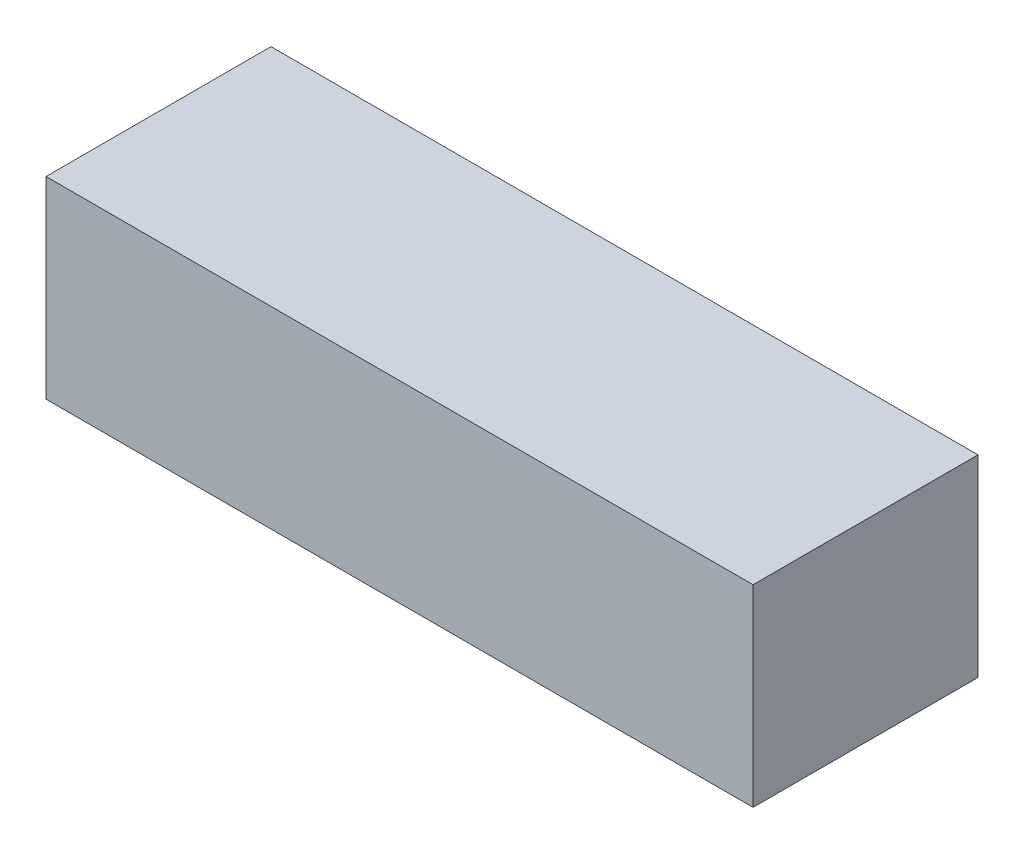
ISO-10303-21;
HEADER;
FILE_DESCRIPTION(('STEP AP214'),'2;1');
FILE_NAME('part.step','',(''),(''),'','','');
FILE_SCHEMA(('AUTOMOTIVE_DESIGN { 1 0 10303 214 1 1 1 1 }'));
ENDSEC;
DATA;
#1=APPLICATION_CONTEXT('core data for automotive mechanical design processes');
#2=APPLICATION_PROTOCOL_DEFINITION('international standard','automotive_design',2000,#1);
#3=PRODUCT_CONTEXT('',#1,'mechanical');
#4=PRODUCT('Part','Part','',(#3));
#5=PRODUCT_RELATED_PRODUCT_CATEGORY('part','',(#4));
#6=PRODUCT_DEFINITION_FORMATION('','',#4);
#7=PRODUCT_DEFINITION_CONTEXT('part definition',#1,'design');
#8=PRODUCT_DEFINITION('design','',#6,#7);
#9=PRODUCT_DEFINITION_SHAPE('','',#8);
#10=(LENGTH_UNIT() NAMED_UNIT(*) SI_UNIT(.MILLI.,.METRE.));
#11=(NAMED_UNIT(*) PLANE_ANGLE_UNIT() SI_UNIT($,.RADIAN.));
#12=(NAMED_UNIT(*) SI_UNIT($,.STERADIAN.) SOLID_ANGLE_UNIT());
#13=UNCERTAINTY_MEASURE_WITH_UNIT(LENGTH_MEASURE(1.E-05),#10,'distance_accuracy_value','');
#14=(GEOMETRIC_REPRESENTATION_CONTEXT(3) GLOBAL_UNCERTAINTY_ASSIGNED_CONTEXT((#13)) GLOBAL_UNIT_ASSIGNED_CONTEXT((#10,
#11,#12)) REPRESENTATION_CONTEXT('',''));
#15=CARTESIAN_POINT('',(0.,0.,0.));
#16=DIRECTION('',(0.,0.,1.));
#17=DIRECTION('',(1.,0.,0.));
#18=AXIS2_PLACEMENT_3D('',#15,#16,#17);
#19=CARTESIAN_POINT('',(-69.85,38.1,22.225));
#20=DIRECTION('',(1.,0.,0.));
#21=DIRECTION('',(0.,0.,-1.));
#22=AXIS2_PLACEMENT_3D('',#19,#20,#21);
#23=PLANE('',#22);
#24=DIRECTION('',(0.,0.,1.));
#25=VECTOR('',#24,1.);
#26=CARTESIAN_POINT('',(-69.85,0.,22.225));
#27=LINE('',#26,#25);
#28=CARTESIAN_POINT('',(-69.85,0.,-22.225));
#29=VERTEX_POINT('',#28);
#30=CARTESIAN_POINT('',(-69.85,0.,22.225));
#31=VERTEX_POINT('',#30);
#32=EDGE_CURVE('E114',#29,#31,#27,.T.);
#33=ORIENTED_EDGE('',*,*,#32,.T.);
#34=DIRECTION('',(0.,-1.,0.));
#35=VECTOR('',#34,1.);
#36=CARTESIAN_POINT('',(-69.85,38.1,22.225));
#37=LINE('',#36,#35);
#38=CARTESIAN_POINT('',(-69.85,38.1,22.225));
#39=VERTEX_POINT('',#38);
#40=EDGE_CURVE('E11',#39,#31,#37,.T.);
#41=ORIENTED_EDGE('',*,*,#40,.F.);
#42=DIRECTION('',(0.,0.,1.));
#43=VECTOR('',#42,1.);
#44=CARTESIAN_POINT('',(-69.85,38.1,22.225));
#45=LINE('',#44,#43);
#46=CARTESIAN_POINT('',(-69.85,38.1,-22.225));
#47=VERTEX_POINT('',#46);
#48=EDGE_CURVE('E97',#47,#39,#45,.T.);
#49=ORIENTED_EDGE('',*,*,#48,.F.);
#50=DIRECTION('',(0.,-1.,0.));
#51=VECTOR('',#50,1.);
#52=CARTESIAN_POINT('',(-69.85,38.1,-22.225));
#53=LINE('',#52,#51);
#54=EDGE_CURVE('E110',#47,#29,#53,.T.);
#55=ORIENTED_EDGE('',*,*,#54,.T.);
#56=EDGE_LOOP('',(#33,#41,#49,#55));
#57=FACE_BOUND('',#56,.T.);
#58=ADVANCED_FACE('F45',(#57),#23,.F.);
#59=CARTESIAN_POINT('',(69.85,38.1,22.225));
#60=DIRECTION('',(0.,0.,-1.));
#61=DIRECTION('',(-1.,0.,0.));
#62=AXIS2_PLACEMENT_3D('',#59,#60,#61);
#63=PLANE('',#62);
#64=DIRECTION('',(1.,0.,0.));
#65=VECTOR('',#64,1.);
#66=CARTESIAN_POINT('',(69.85,0.,22.225));
#67=LINE('',#66,#65);
#68=CARTESIAN_POINT('',(69.85,0.,22.225));
#69=VERTEX_POINT('',#68);
#70=EDGE_CURVE('E102',#31,#69,#67,.T.);
#71=ORIENTED_EDGE('',*,*,#70,.T.);
#72=DIRECTION('',(0.,-1.,0.));
#73=VECTOR('',#72,1.);
#74=CARTESIAN_POINT('',(69.85,38.1,22.225));
#75=LINE('',#74,#73);
#76=CARTESIAN_POINT('',(69.85,38.1,22.225));
#77=VERTEX_POINT('',#76);
#78=EDGE_CURVE('E54',#77,#69,#75,.T.);
#79=ORIENTED_EDGE('',*,*,#78,.F.);
#80=DIRECTION('',(1.,0.,0.));
#81=VECTOR('',#80,1.);
#82=CARTESIAN_POINT('',(69.85,38.1,22.225));
#83=LINE('',#82,#81);
#84=EDGE_CURVE('E92',#39,#77,#83,.T.);
#85=ORIENTED_EDGE('',*,*,#84,.F.);
#86=ORIENTED_EDGE('',*,*,#40,.T.);
#87=EDGE_LOOP('',(#71,#79,#85,#86));
#88=FACE_BOUND('',#87,.T.);
#89=ADVANCED_FACE('F101',(#88),#63,.F.);
#90=CARTESIAN_POINT('',(69.85,38.1,22.225));
#91=DIRECTION('',(-1.,0.,0.));
#92=DIRECTION('',(0.,0.,1.));
#93=AXIS2_PLACEMENT_3D('',#90,#91,#92);
#94=PLANE('',#93);
#95=DIRECTION('',(0.,0.,-1.));
#96=VECTOR('',#95,1.);
#97=CARTESIAN_POINT('',(69.85,0.,22.225));
#98=LINE('',#97,#96);
#99=CARTESIAN_POINT('',(69.85,0.,-22.225));
#100=VERTEX_POINT('',#99);
#101=EDGE_CURVE('E79',#69,#100,#98,.T.);
#102=ORIENTED_EDGE('',*,*,#101,.T.);
#103=DIRECTION('',(0.,-1.,0.));
#104=VECTOR('',#103,1.);
#105=CARTESIAN_POINT('',(69.85,38.1,-22.225));
#106=LINE('',#105,#104);
#107=CARTESIAN_POINT('',(69.85,38.1,-22.225));
#108=VERTEX_POINT('',#107);
#109=EDGE_CURVE('E104',#108,#100,#106,.T.);
#110=ORIENTED_EDGE('',*,*,#109,.F.);
#111=DIRECTION('',(0.,0.,-1.));
#112=VECTOR('',#111,1.);
#113=CARTESIAN_POINT('',(69.85,38.1,22.225));
#114=LINE('',#113,#112);
#115=EDGE_CURVE('E95',#77,#108,#114,.T.);
#116=ORIENTED_EDGE('',*,*,#115,.F.);
#117=ORIENTED_EDGE('',*,*,#78,.T.);
#118=EDGE_LOOP('',(#102,#110,#116,#117));
#119=FACE_BOUND('',#118,.T.);
#120=ADVANCED_FACE('F105',(#119),#94,.F.);
#121=CARTESIAN_POINT('',(69.85,38.1,-22.225));
#122=DIRECTION('',(0.,0.,1.));
#123=DIRECTION('',(1.,0.,0.));
#124=AXIS2_PLACEMENT_3D('',#121,#122,#123);
#125=PLANE('',#124);
#126=DIRECTION('',(-1.,0.,0.));
#127=VECTOR('',#126,1.);
#128=CARTESIAN_POINT('',(69.85,0.,-22.225));
#129=LINE('',#128,#127);
#130=EDGE_CURVE('E85',#100,#29,#129,.T.);
#131=ORIENTED_EDGE('',*,*,#130,.T.);
#132=ORIENTED_EDGE('',*,*,#54,.F.);
#133=DIRECTION('',(-1.,0.,0.));
#134=VECTOR('',#133,1.);
#135=CARTESIAN_POINT('',(69.85,38.1,-22.225));
#136=LINE('',#135,#134);
#137=EDGE_CURVE('E62',#108,#47,#136,.T.);
#138=ORIENTED_EDGE('',*,*,#137,.F.);
#139=ORIENTED_EDGE('',*,*,#109,.T.);
#140=EDGE_LOOP('',(#131,#132,#138,#139));
#141=FACE_BOUND('',#140,.T.);
#142=ADVANCED_FACE('F128',(#141),#125,.F.);
#143=CARTESIAN_POINT('',(0.,38.1,0.));
#144=DIRECTION('',(0.,1.,0.));
#145=DIRECTION('',(0.,0.,1.));
#146=AXIS2_PLACEMENT_3D('',#143,#144,#145);
#147=PLANE('',#146);
#148=ORIENTED_EDGE('',*,*,#48,.T.);
#149=ORIENTED_EDGE('',*,*,#84,.T.);
#150=ORIENTED_EDGE('',*,*,#115,.T.);
#151=ORIENTED_EDGE('',*,*,#137,.T.);
#152=EDGE_LOOP('',(#148,#149,#150,#151));
#153=FACE_BOUND('',#152,.T.);
#154=ADVANCED_FACE('F93',(#153),#147,.T.);
#155=CARTESIAN_POINT('',(0.,0.,0.));
#156=DIRECTION('',(0.,1.,0.));
#157=DIRECTION('',(0.,0.,1.));
#158=AXIS2_PLACEMENT_3D('',#155,#156,#157);
#159=PLANE('',#158);
#160=ORIENTED_EDGE('',*,*,#32,.F.);
#161=ORIENTED_EDGE('',*,*,#130,.F.);
#162=ORIENTED_EDGE('',*,*,#101,.F.);
#163=ORIENTED_EDGE('',*,*,#70,.F.);
#164=EDGE_LOOP('',(#160,#161,#162,#163));
#165=FACE_BOUND('',#164,.T.);
#166=ADVANCED_FACE('F131',(#165),#159,.F.);
#167=CLOSED_SHELL('',(#58,#89,#120,#142,#154,#166));
#168=MANIFOLD_SOLID_BREP('B2',#167);
#169=ADVANCED_BREP_SHAPE_REPRESENTATION('',(#18,#168),#14);
#170=SHAPE_DEFINITION_REPRESENTATION(#9,#169);
ENDSEC;
END-ISO-10303-21;
